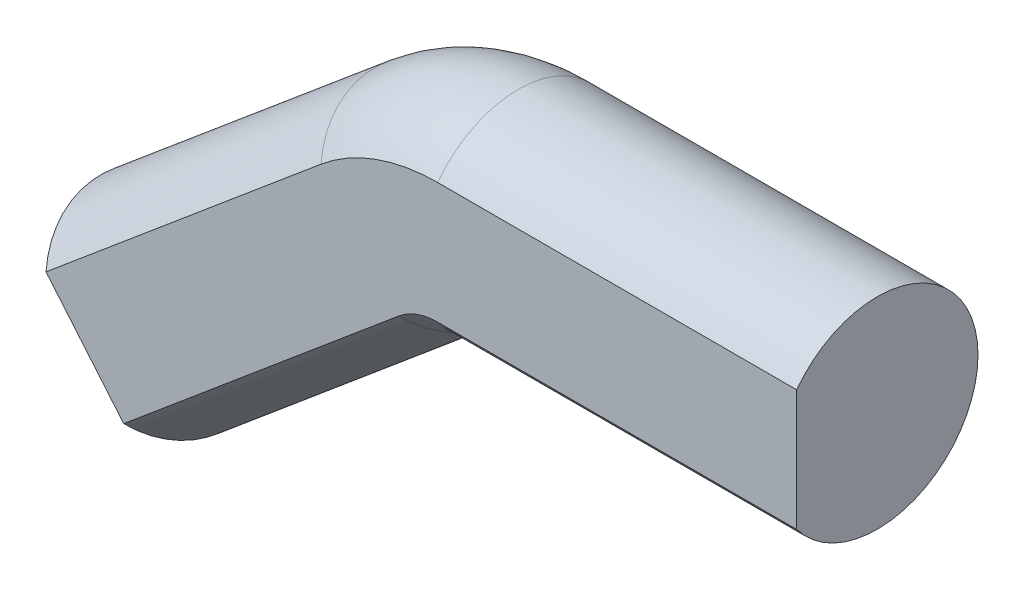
from build123d import *

# Parameters (mm, degrees)
AUSTRAGUNG1_PROFILE_R = 12.5


with BuildPart() as part:
    # Austragung1: sweep along a path in Skizze1
    with BuildLine(Plane.XY) as austragung1_path:
        Line((-38.302222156, -32.139380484), (-4.182260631, -3.509333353))
        ThreePointArc((-4.182260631, -3.509333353), (0.329251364, -0.904610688), (5.459553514, 0))
        Line((5.459553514, 0), (50, 0))
    # Austragung1 profile (on start of the path) → Austragung1 (sweep)
    with BuildSketch(Plane(origin=(-38.302222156, -32.139380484, 0), x_dir=(-0.6427876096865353, 0.7660444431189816, 0), z_dir=(0.7660444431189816, 0.6427876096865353, 0))):
        Circle(AUSTRAGUNG1_PROFILE_R)
    sweep(path=austragung1_path.line)

    # Oberfl_chenschnitt1
    split(bisect_by=Plane.XY.offset(10), keep=Keep.BOTTOM)


solid = part.part
